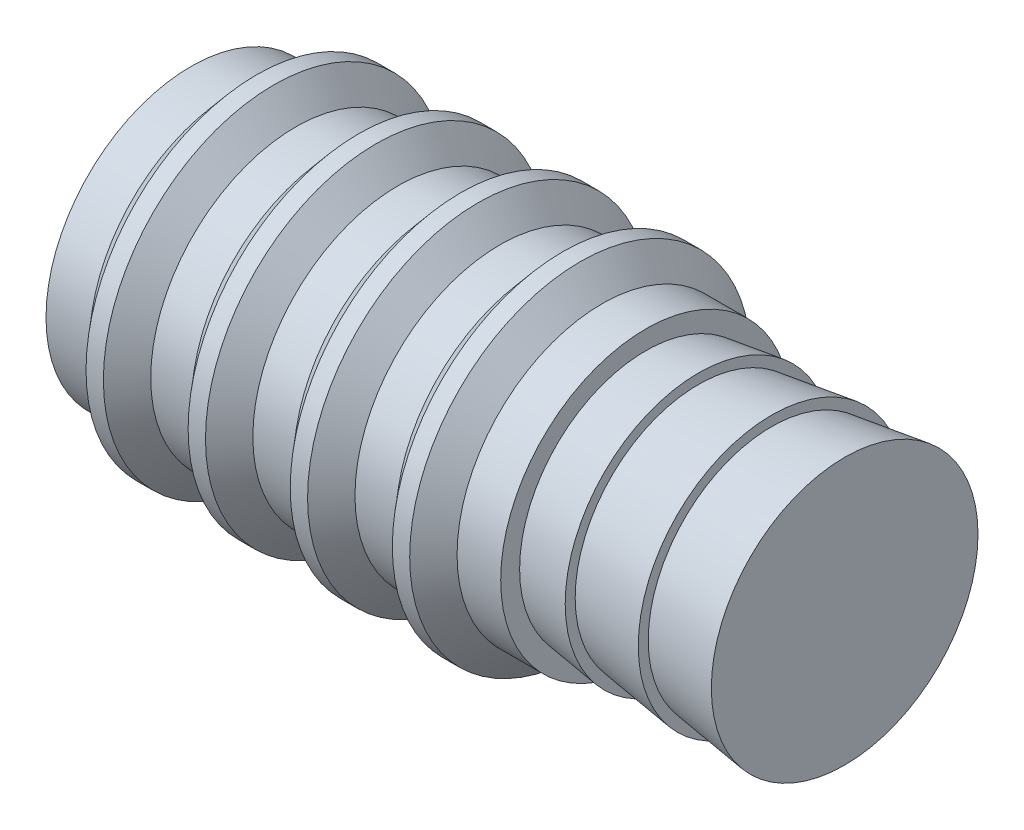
ISO-10303-21;
HEADER;
FILE_DESCRIPTION(('STEP AP214'),'2;1');
FILE_NAME('part.step','',(''),(''),'','','');
FILE_SCHEMA(('AUTOMOTIVE_DESIGN { 1 0 10303 214 1 1 1 1 }'));
ENDSEC;
DATA;
#1=APPLICATION_CONTEXT('core data for automotive mechanical design processes');
#2=APPLICATION_PROTOCOL_DEFINITION('international standard','automotive_design',2000,#1);
#3=PRODUCT_CONTEXT('',#1,'mechanical');
#4=PRODUCT('Part','Part','',(#3));
#5=PRODUCT_RELATED_PRODUCT_CATEGORY('part','',(#4));
#6=PRODUCT_DEFINITION_FORMATION('','',#4);
#7=PRODUCT_DEFINITION_CONTEXT('part definition',#1,'design');
#8=PRODUCT_DEFINITION('design','',#6,#7);
#9=PRODUCT_DEFINITION_SHAPE('','',#8);
#10=(LENGTH_UNIT() NAMED_UNIT(*) SI_UNIT(.MILLI.,.METRE.));
#11=(NAMED_UNIT(*) PLANE_ANGLE_UNIT() SI_UNIT($,.RADIAN.));
#12=(NAMED_UNIT(*) SI_UNIT($,.STERADIAN.) SOLID_ANGLE_UNIT());
#13=UNCERTAINTY_MEASURE_WITH_UNIT(LENGTH_MEASURE(1.E-05),#10,'distance_accuracy_value','');
#14=(GEOMETRIC_REPRESENTATION_CONTEXT(3) GLOBAL_UNCERTAINTY_ASSIGNED_CONTEXT((#13)) GLOBAL_UNIT_ASSIGNED_CONTEXT((#10,
#11,#12)) REPRESENTATION_CONTEXT('',''));
#15=CARTESIAN_POINT('',(0.,0.,0.));
#16=DIRECTION('',(0.,0.,1.));
#17=DIRECTION('',(1.,0.,0.));
#18=AXIS2_PLACEMENT_3D('',#15,#16,#17);
#19=CARTESIAN_POINT('',(11.5,0.,0.));
#20=DIRECTION('',(1.,0.,0.));
#21=DIRECTION('',(0.,0.,-1.));
#22=AXIS2_PLACEMENT_3D('',#19,#20,#21);
#23=PLANE('',#22);
#24=CARTESIAN_POINT('',(11.5,0.,0.));
#25=DIRECTION('',(-1.,0.,0.));
#26=DIRECTION('',(0.,0.,1.));
#27=AXIS2_PLACEMENT_3D('',#24,#25,#26);
#28=CIRCLE('',#27,2.34574421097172);
#29=CARTESIAN_POINT('',(11.5,0.,2.34574421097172));
#30=VERTEX_POINT('',#29);
#31=EDGE_CURVE('E9',#30,#30,#28,.T.);
#32=ORIENTED_EDGE('',*,*,#31,.F.);
#33=EDGE_LOOP('',(#32));
#34=FACE_BOUND('',#33,.T.);
#35=ADVANCED_FACE('F14',(#34),#23,.T.);
#36=CARTESIAN_POINT('',(10.2144174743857,0.,0.));
#37=DIRECTION('',(1.,0.,0.));
#38=DIRECTION('',(0.,0.,-1.));
#39=AXIS2_PLACEMENT_3D('',#36,#37,#38);
#40=CONICAL_SURFACE('',#39,2.17009195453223,0.135791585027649);
#41=ORIENTED_EDGE('',*,*,#31,.T.);
#42=EDGE_LOOP('',(#41));
#43=FACE_BOUND('',#42,.T.);
#44=CARTESIAN_POINT('',(10.2144174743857,0.,0.));
#45=DIRECTION('',(-1.,0.,0.));
#46=DIRECTION('',(0.,0.,1.));
#47=AXIS2_PLACEMENT_3D('',#44,#45,#46);
#48=CIRCLE('',#47,2.17009195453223);
#49=CARTESIAN_POINT('',(10.2144174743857,0.,2.17009195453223));
#50=VERTEX_POINT('',#49);
#51=EDGE_CURVE('E20',#50,#50,#48,.T.);
#52=ORIENTED_EDGE('',*,*,#51,.F.);
#53=EDGE_LOOP('',(#52));
#54=FACE_BOUND('',#53,.T.);
#55=ADVANCED_FACE('F146',(#43,#54),#40,.T.);
#56=CARTESIAN_POINT('',(10.2144174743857,0.,0.));
#57=DIRECTION('',(1.,0.,0.));
#58=DIRECTION('',(0.,0.,-1.));
#59=AXIS2_PLACEMENT_3D('',#56,#57,#58);
#60=PLANE('',#59);
#61=ORIENTED_EDGE('',*,*,#51,.T.);
#62=EDGE_LOOP('',(#61));
#63=FACE_BOUND('',#62,.T.);
#64=CARTESIAN_POINT('',(10.2144174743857,0.,0.));
#65=DIRECTION('',(-1.,0.,0.));
#66=DIRECTION('',(0.,0.,1.));
#67=AXIS2_PLACEMENT_3D('',#64,#65,#66);
#68=CIRCLE('',#67,2.34574421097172);
#69=CARTESIAN_POINT('',(10.2144174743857,0.,2.34574421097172));
#70=VERTEX_POINT('',#69);
#71=EDGE_CURVE('E24',#70,#70,#68,.T.);
#72=ORIENTED_EDGE('',*,*,#71,.F.);
#73=EDGE_LOOP('',(#72));
#74=FACE_BOUND('',#73,.T.);
#75=ADVANCED_FACE('F152',(#63,#74),#60,.T.);
#76=CARTESIAN_POINT('',(8.9288349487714,0.,0.));
#77=DIRECTION('',(1.,0.,0.));
#78=DIRECTION('',(0.,0.,-1.));
#79=AXIS2_PLACEMENT_3D('',#76,#77,#78);
#80=CONICAL_SURFACE('',#79,2.17009195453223,0.135791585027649);
#81=ORIENTED_EDGE('',*,*,#71,.T.);
#82=EDGE_LOOP('',(#81));
#83=FACE_BOUND('',#82,.T.);
#84=CARTESIAN_POINT('',(8.9288349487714,0.,0.));
#85=DIRECTION('',(-1.,0.,0.));
#86=DIRECTION('',(0.,0.,1.));
#87=AXIS2_PLACEMENT_3D('',#84,#85,#86);
#88=CIRCLE('',#87,2.17009195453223);
#89=CARTESIAN_POINT('',(8.9288349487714,0.,2.17009195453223));
#90=VERTEX_POINT('',#89);
#91=EDGE_CURVE('E28',#90,#90,#88,.T.);
#92=ORIENTED_EDGE('',*,*,#91,.F.);
#93=EDGE_LOOP('',(#92));
#94=FACE_BOUND('',#93,.T.);
#95=ADVANCED_FACE('F157',(#83,#94),#80,.T.);
#96=CARTESIAN_POINT('',(8.9288349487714,0.,0.));
#97=DIRECTION('',(1.,0.,0.));
#98=DIRECTION('',(0.,0.,-1.));
#99=AXIS2_PLACEMENT_3D('',#96,#97,#98);
#100=PLANE('',#99);
#101=ORIENTED_EDGE('',*,*,#91,.T.);
#102=EDGE_LOOP('',(#101));
#103=FACE_BOUND('',#102,.T.);
#104=CARTESIAN_POINT('',(8.9288349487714,0.,0.));
#105=DIRECTION('',(-1.,0.,0.));
#106=DIRECTION('',(0.,0.,1.));
#107=AXIS2_PLACEMENT_3D('',#104,#105,#106);
#108=CIRCLE('',#107,2.34574421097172);
#109=CARTESIAN_POINT('',(8.9288349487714,0.,2.34574421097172));
#110=VERTEX_POINT('',#109);
#111=EDGE_CURVE('E33',#110,#110,#108,.T.);
#112=ORIENTED_EDGE('',*,*,#111,.F.);
#113=EDGE_LOOP('',(#112));
#114=FACE_BOUND('',#113,.T.);
#115=ADVANCED_FACE('F163',(#103,#114),#100,.T.);
#116=CARTESIAN_POINT('',(8.,0.,0.));
#117=DIRECTION('',(1.,0.,0.));
#118=DIRECTION('',(0.,0.,-1.));
#119=AXIS2_PLACEMENT_3D('',#116,#117,#118);
#120=CONICAL_SURFACE('',#119,2.2188352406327,0.135791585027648);
#121=ORIENTED_EDGE('',*,*,#111,.T.);
#122=EDGE_LOOP('',(#121));
#123=FACE_BOUND('',#122,.T.);
#124=CARTESIAN_POINT('',(8.,0.,0.));
#125=DIRECTION('',(-1.,0.,0.));
#126=DIRECTION('',(0.,0.,1.));
#127=AXIS2_PLACEMENT_3D('',#124,#125,#126);
#128=CIRCLE('',#127,2.2188352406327);
#129=CARTESIAN_POINT('',(8.,0.,2.2188352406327));
#130=VERTEX_POINT('',#129);
#131=EDGE_CURVE('E36',#130,#130,#128,.T.);
#132=ORIENTED_EDGE('',*,*,#131,.F.);
#133=EDGE_LOOP('',(#132));
#134=FACE_BOUND('',#133,.T.);
#135=ADVANCED_FACE('F167',(#123,#134),#120,.T.);
#136=CARTESIAN_POINT('',(8.,0.,0.));
#137=DIRECTION('',(1.,0.,0.));
#138=DIRECTION('',(0.,0.,-1.));
#139=AXIS2_PLACEMENT_3D('',#136,#137,#138);
#140=PLANE('',#139);
#141=ORIENTED_EDGE('',*,*,#131,.T.);
#142=EDGE_LOOP('',(#141));
#143=FACE_BOUND('',#142,.T.);
#144=CARTESIAN_POINT('',(8.,0.,0.));
#145=DIRECTION('',(-1.,0.,0.));
#146=DIRECTION('',(0.,0.,1.));
#147=AXIS2_PLACEMENT_3D('',#144,#145,#146);
#148=CIRCLE('',#147,2.55133027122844);
#149=CARTESIAN_POINT('',(8.,0.,2.55133027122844));
#150=VERTEX_POINT('',#149);
#151=EDGE_CURVE('E39',#150,#150,#148,.T.);
#152=ORIENTED_EDGE('',*,*,#151,.F.);
#153=EDGE_LOOP('',(#152));
#154=FACE_BOUND('',#153,.T.);
#155=ADVANCED_FACE('F171',(#143,#154),#140,.T.);
#156=CARTESIAN_POINT('',(0.,0.,0.));
#157=DIRECTION('',(-1.,0.,0.));
#158=DIRECTION('',(0.,0.,1.));
#159=AXIS2_PLACEMENT_3D('',#156,#157,#158);
#160=CYLINDRICAL_SURFACE('',#159,2.55133027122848);
#161=CARTESIAN_POINT('',(7.23177629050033,0.,0.));
#162=DIRECTION('',(-1.,0.,0.));
#163=DIRECTION('',(0.,0.,1.));
#164=AXIS2_PLACEMENT_3D('',#161,#162,#163);
#165=CIRCLE('',#164,2.55133027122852);
#166=CARTESIAN_POINT('',(7.23177629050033,0.,2.55133027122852));
#167=VERTEX_POINT('',#166);
#168=EDGE_CURVE('E42',#167,#167,#165,.T.);
#169=ORIENTED_EDGE('',*,*,#168,.F.);
#170=EDGE_LOOP('',(#169));
#171=FACE_BOUND('',#170,.T.);
#172=ORIENTED_EDGE('',*,*,#151,.T.);
#173=EDGE_LOOP('',(#172));
#174=FACE_BOUND('',#173,.T.);
#175=ADVANCED_FACE('F175',(#171,#174),#160,.T.);
#176=CARTESIAN_POINT('',(7.23177629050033,0.,0.));
#177=DIRECTION('',(-1.,0.,0.));
#178=DIRECTION('',(0.,0.,1.));
#179=AXIS2_PLACEMENT_3D('',#176,#177,#178);
#180=CONICAL_SURFACE('',#179,2.55133027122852,0.862170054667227);
#181=CARTESIAN_POINT('',(6.84720223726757,0.,0.));
#182=DIRECTION('',(-1.,0.,0.));
#183=DIRECTION('',(0.,0.,1.));
#184=AXIS2_PLACEMENT_3D('',#181,#182,#183);
#185=CIRCLE('',#184,3.00000000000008);
#186=CARTESIAN_POINT('',(6.84720223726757,0.,3.00000000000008));
#187=VERTEX_POINT('',#186);
#188=EDGE_CURVE('E45',#187,#187,#185,.T.);
#189=ORIENTED_EDGE('',*,*,#188,.F.);
#190=EDGE_LOOP('',(#189));
#191=FACE_BOUND('',#190,.T.);
#192=ORIENTED_EDGE('',*,*,#168,.T.);
#193=EDGE_LOOP('',(#192));
#194=FACE_BOUND('',#193,.T.);
#195=ADVANCED_FACE('F179',(#191,#194),#180,.T.);
#196=CARTESIAN_POINT('',(0.,0.,0.));
#197=DIRECTION('',(-1.,0.,0.));
#198=DIRECTION('',(0.,0.,1.));
#199=AXIS2_PLACEMENT_3D('',#196,#197,#198);
#200=CYLINDRICAL_SURFACE('',#199,3.00000000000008);
#201=ORIENTED_EDGE('',*,*,#188,.T.);
#202=EDGE_LOOP('',(#201));
#203=FACE_BOUND('',#202,.T.);
#204=CARTESIAN_POINT('',(6.54182407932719,0.,0.));
#205=DIRECTION('',(-1.,0.,0.));
#206=DIRECTION('',(0.,0.,1.));
#207=AXIS2_PLACEMENT_3D('',#204,#205,#206);
#208=CIRCLE('',#207,3.00000000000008);
#209=CARTESIAN_POINT('',(6.54182407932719,0.,3.00000000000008));
#210=VERTEX_POINT('',#209);
#211=EDGE_CURVE('E48',#210,#210,#208,.T.);
#212=ORIENTED_EDGE('',*,*,#211,.F.);
#213=EDGE_LOOP('',(#212));
#214=FACE_BOUND('',#213,.T.);
#215=ADVANCED_FACE('F183',(#203,#214),#200,.T.);
#216=CARTESIAN_POINT('',(6.15725002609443,0.,0.));
#217=DIRECTION('',(1.,0.,0.));
#218=DIRECTION('',(0.,0.,-1.));
#219=AXIS2_PLACEMENT_3D('',#216,#217,#218);
#220=CONICAL_SURFACE('',#219,2.55133027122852,0.862170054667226);
#221=ORIENTED_EDGE('',*,*,#211,.T.);
#222=EDGE_LOOP('',(#221));
#223=FACE_BOUND('',#222,.T.);
#224=CARTESIAN_POINT('',(6.15725002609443,0.,0.));
#225=DIRECTION('',(-1.,0.,0.));
#226=DIRECTION('',(0.,0.,1.));
#227=AXIS2_PLACEMENT_3D('',#224,#225,#226);
#228=CIRCLE('',#227,2.55133027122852);
#229=CARTESIAN_POINT('',(6.15725002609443,0.,2.55133027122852));
#230=VERTEX_POINT('',#229);
#231=EDGE_CURVE('E51',#230,#230,#228,.T.);
#232=ORIENTED_EDGE('',*,*,#231,.F.);
#233=EDGE_LOOP('',(#232));
#234=FACE_BOUND('',#233,.T.);
#235=ADVANCED_FACE('F187',(#223,#234),#220,.T.);
#236=CARTESIAN_POINT('',(0.,0.,0.));
#237=DIRECTION('',(-1.,0.,0.));
#238=DIRECTION('',(0.,0.,1.));
#239=AXIS2_PLACEMENT_3D('',#236,#237,#238);
#240=CYLINDRICAL_SURFACE('',#239,2.55133027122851);
#241=CARTESIAN_POINT('',(5.43543418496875,0.,0.));
#242=DIRECTION('',(-1.,0.,0.));
#243=DIRECTION('',(0.,0.,1.));
#244=AXIS2_PLACEMENT_3D('',#241,#242,#243);
#245=CIRCLE('',#244,2.55133027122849);
#246=CARTESIAN_POINT('',(5.43543418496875,0.,2.55133027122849));
#247=VERTEX_POINT('',#246);
#248=EDGE_CURVE('E54',#247,#247,#245,.T.);
#249=ORIENTED_EDGE('',*,*,#248,.F.);
#250=EDGE_LOOP('',(#249));
#251=FACE_BOUND('',#250,.T.);
#252=ORIENTED_EDGE('',*,*,#231,.T.);
#253=EDGE_LOOP('',(#252));
#254=FACE_BOUND('',#253,.T.);
#255=ADVANCED_FACE('F191',(#251,#254),#240,.T.);
#256=CARTESIAN_POINT('',(5.43543418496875,0.,0.));
#257=DIRECTION('',(-1.,0.,0.));
#258=DIRECTION('',(0.,0.,1.));
#259=AXIS2_PLACEMENT_3D('',#256,#257,#258);
#260=CONICAL_SURFACE('',#259,2.55133027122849,0.862170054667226);
#261=CARTESIAN_POINT('',(5.05086013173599,0.,0.));
#262=DIRECTION('',(-1.,0.,0.));
#263=DIRECTION('',(0.,0.,1.));
#264=AXIS2_PLACEMENT_3D('',#261,#262,#263);
#265=CIRCLE('',#264,3.00000000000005);
#266=CARTESIAN_POINT('',(5.05086013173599,0.,3.00000000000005));
#267=VERTEX_POINT('',#266);
#268=EDGE_CURVE('E57',#267,#267,#265,.T.);
#269=ORIENTED_EDGE('',*,*,#268,.F.);
#270=EDGE_LOOP('',(#269));
#271=FACE_BOUND('',#270,.T.);
#272=ORIENTED_EDGE('',*,*,#248,.T.);
#273=EDGE_LOOP('',(#272));
#274=FACE_BOUND('',#273,.T.);
#275=ADVANCED_FACE('F195',(#271,#274),#260,.T.);
#276=CARTESIAN_POINT('',(0.,0.,0.));
#277=DIRECTION('',(-1.,0.,0.));
#278=DIRECTION('',(0.,0.,1.));
#279=AXIS2_PLACEMENT_3D('',#276,#277,#278);
#280=CYLINDRICAL_SURFACE('',#279,3.00000000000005);
#281=ORIENTED_EDGE('',*,*,#268,.T.);
#282=EDGE_LOOP('',(#281));
#283=FACE_BOUND('',#282,.T.);
#284=CARTESIAN_POINT('',(4.74548197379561,0.,0.));
#285=DIRECTION('',(-1.,0.,0.));
#286=DIRECTION('',(0.,0.,1.));
#287=AXIS2_PLACEMENT_3D('',#284,#285,#286);
#288=CIRCLE('',#287,3.00000000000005);
#289=CARTESIAN_POINT('',(4.74548197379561,0.,3.00000000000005));
#290=VERTEX_POINT('',#289);
#291=EDGE_CURVE('E60',#290,#290,#288,.T.);
#292=ORIENTED_EDGE('',*,*,#291,.F.);
#293=EDGE_LOOP('',(#292));
#294=FACE_BOUND('',#293,.T.);
#295=ADVANCED_FACE('F199',(#283,#294),#280,.T.);
#296=CARTESIAN_POINT('',(4.36090792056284,0.,0.));
#297=DIRECTION('',(1.,0.,0.));
#298=DIRECTION('',(0.,0.,-1.));
#299=AXIS2_PLACEMENT_3D('',#296,#297,#298);
#300=CONICAL_SURFACE('',#299,2.55133027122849,0.862170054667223);
#301=ORIENTED_EDGE('',*,*,#291,.T.);
#302=EDGE_LOOP('',(#301));
#303=FACE_BOUND('',#302,.T.);
#304=CARTESIAN_POINT('',(4.36090792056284,0.,0.));
#305=DIRECTION('',(-1.,0.,0.));
#306=DIRECTION('',(0.,0.,1.));
#307=AXIS2_PLACEMENT_3D('',#304,#305,#306);
#308=CIRCLE('',#307,2.55133027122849);
#309=CARTESIAN_POINT('',(4.36090792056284,0.,2.55133027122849));
#310=VERTEX_POINT('',#309);
#311=EDGE_CURVE('E63',#310,#310,#308,.T.);
#312=ORIENTED_EDGE('',*,*,#311,.F.);
#313=EDGE_LOOP('',(#312));
#314=FACE_BOUND('',#313,.T.);
#315=ADVANCED_FACE('F203',(#303,#314),#300,.T.);
#316=CARTESIAN_POINT('',(0.,0.,0.));
#317=DIRECTION('',(-1.,0.,0.));
#318=DIRECTION('',(0.,0.,1.));
#319=AXIS2_PLACEMENT_3D('',#316,#317,#318);
#320=CYLINDRICAL_SURFACE('',#319,2.55133027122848);
#321=CARTESIAN_POINT('',(3.63909207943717,0.,0.));
#322=DIRECTION('',(-1.,0.,0.));
#323=DIRECTION('',(0.,0.,1.));
#324=AXIS2_PLACEMENT_3D('',#321,#322,#323);
#325=CIRCLE('',#324,2.55133027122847);
#326=CARTESIAN_POINT('',(3.63909207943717,0.,2.55133027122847));
#327=VERTEX_POINT('',#326);
#328=EDGE_CURVE('E66',#327,#327,#325,.T.);
#329=ORIENTED_EDGE('',*,*,#328,.F.);
#330=EDGE_LOOP('',(#329));
#331=FACE_BOUND('',#330,.T.);
#332=ORIENTED_EDGE('',*,*,#311,.T.);
#333=EDGE_LOOP('',(#332));
#334=FACE_BOUND('',#333,.T.);
#335=ADVANCED_FACE('F207',(#331,#334),#320,.T.);
#336=CARTESIAN_POINT('',(3.63909207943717,0.,0.));
#337=DIRECTION('',(-1.,0.,0.));
#338=DIRECTION('',(0.,0.,1.));
#339=AXIS2_PLACEMENT_3D('',#336,#337,#338);
#340=CONICAL_SURFACE('',#339,2.55133027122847,0.862170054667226);
#341=CARTESIAN_POINT('',(3.25451802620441,0.,0.));
#342=DIRECTION('',(-1.,0.,0.));
#343=DIRECTION('',(0.,0.,1.));
#344=AXIS2_PLACEMENT_3D('',#341,#342,#343);
#345=CIRCLE('',#344,3.);
#346=CARTESIAN_POINT('',(3.25451802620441,0.,3.));
#347=VERTEX_POINT('',#346);
#348=EDGE_CURVE('E69',#347,#347,#345,.T.);
#349=ORIENTED_EDGE('',*,*,#348,.F.);
#350=EDGE_LOOP('',(#349));
#351=FACE_BOUND('',#350,.T.);
#352=ORIENTED_EDGE('',*,*,#328,.T.);
#353=EDGE_LOOP('',(#352));
#354=FACE_BOUND('',#353,.T.);
#355=ADVANCED_FACE('F211',(#351,#354),#340,.T.);
#356=CARTESIAN_POINT('',(0.,0.,0.));
#357=DIRECTION('',(-1.,0.,0.));
#358=DIRECTION('',(0.,0.,1.));
#359=AXIS2_PLACEMENT_3D('',#356,#357,#358);
#360=CYLINDRICAL_SURFACE('',#359,3.);
#361=ORIENTED_EDGE('',*,*,#348,.T.);
#362=EDGE_LOOP('',(#361));
#363=FACE_BOUND('',#362,.T.);
#364=CARTESIAN_POINT('',(2.94913986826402,0.,0.));
#365=DIRECTION('',(-1.,0.,0.));
#366=DIRECTION('',(0.,0.,1.));
#367=AXIS2_PLACEMENT_3D('',#364,#365,#366);
#368=CIRCLE('',#367,3.);
#369=CARTESIAN_POINT('',(2.94913986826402,0.,3.));
#370=VERTEX_POINT('',#369);
#371=EDGE_CURVE('E72',#370,#370,#368,.T.);
#372=ORIENTED_EDGE('',*,*,#371,.F.);
#373=EDGE_LOOP('',(#372));
#374=FACE_BOUND('',#373,.T.);
#375=ADVANCED_FACE('F215',(#363,#374),#360,.T.);
#376=CARTESIAN_POINT('',(2.56456581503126,0.,0.));
#377=DIRECTION('',(1.,0.,0.));
#378=DIRECTION('',(0.,0.,-1.));
#379=AXIS2_PLACEMENT_3D('',#376,#377,#378);
#380=CONICAL_SURFACE('',#379,2.55133027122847,0.862170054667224);
#381=ORIENTED_EDGE('',*,*,#371,.T.);
#382=EDGE_LOOP('',(#381));
#383=FACE_BOUND('',#382,.T.);
#384=CARTESIAN_POINT('',(2.56456581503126,0.,0.));
#385=DIRECTION('',(-1.,0.,0.));
#386=DIRECTION('',(0.,0.,1.));
#387=AXIS2_PLACEMENT_3D('',#384,#385,#386);
#388=CIRCLE('',#387,2.55133027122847);
#389=CARTESIAN_POINT('',(2.56456581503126,0.,2.55133027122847));
#390=VERTEX_POINT('',#389);
#391=EDGE_CURVE('E75',#390,#390,#388,.T.);
#392=ORIENTED_EDGE('',*,*,#391,.F.);
#393=EDGE_LOOP('',(#392));
#394=FACE_BOUND('',#393,.T.);
#395=ADVANCED_FACE('F219',(#383,#394),#380,.T.);
#396=CARTESIAN_POINT('',(0.,0.,0.));
#397=DIRECTION('',(-1.,0.,0.));
#398=DIRECTION('',(0.,0.,1.));
#399=AXIS2_PLACEMENT_3D('',#396,#397,#398);
#400=CYLINDRICAL_SURFACE('',#399,2.55133027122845);
#401=CARTESIAN_POINT('',(1.84274997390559,0.,0.));
#402=DIRECTION('',(-1.,0.,0.));
#403=DIRECTION('',(0.,0.,1.));
#404=AXIS2_PLACEMENT_3D('',#401,#402,#403);
#405=CIRCLE('',#404,2.55133027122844);
#406=CARTESIAN_POINT('',(1.84274997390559,0.,2.55133027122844));
#407=VERTEX_POINT('',#406);
#408=EDGE_CURVE('E78',#407,#407,#405,.T.);
#409=ORIENTED_EDGE('',*,*,#408,.F.);
#410=EDGE_LOOP('',(#409));
#411=FACE_BOUND('',#410,.T.);
#412=ORIENTED_EDGE('',*,*,#391,.T.);
#413=EDGE_LOOP('',(#412));
#414=FACE_BOUND('',#413,.T.);
#415=ADVANCED_FACE('F223',(#411,#414),#400,.T.);
#416=CARTESIAN_POINT('',(1.84274997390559,0.,0.));
#417=DIRECTION('',(-1.,0.,0.));
#418=DIRECTION('',(0.,0.,1.));
#419=AXIS2_PLACEMENT_3D('',#416,#417,#418);
#420=CONICAL_SURFACE('',#419,2.55133027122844,0.862170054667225);
#421=CARTESIAN_POINT('',(1.45817592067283,0.,0.));
#422=DIRECTION('',(-1.,0.,0.));
#423=DIRECTION('',(0.,0.,1.));
#424=AXIS2_PLACEMENT_3D('',#421,#422,#423);
#425=CIRCLE('',#424,3.);
#426=CARTESIAN_POINT('',(1.45817592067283,0.,3.));
#427=VERTEX_POINT('',#426);
#428=EDGE_CURVE('E81',#427,#427,#425,.T.);
#429=ORIENTED_EDGE('',*,*,#428,.F.);
#430=EDGE_LOOP('',(#429));
#431=FACE_BOUND('',#430,.T.);
#432=ORIENTED_EDGE('',*,*,#408,.T.);
#433=EDGE_LOOP('',(#432));
#434=FACE_BOUND('',#433,.T.);
#435=ADVANCED_FACE('F227',(#431,#434),#420,.T.);
#436=CARTESIAN_POINT('',(0.,0.,0.));
#437=DIRECTION('',(-1.,0.,0.));
#438=DIRECTION('',(0.,0.,1.));
#439=AXIS2_PLACEMENT_3D('',#436,#437,#438);
#440=CYLINDRICAL_SURFACE('',#439,3.);
#441=ORIENTED_EDGE('',*,*,#428,.T.);
#442=EDGE_LOOP('',(#441));
#443=FACE_BOUND('',#442,.T.);
#444=CARTESIAN_POINT('',(1.15279776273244,0.,0.));
#445=DIRECTION('',(-1.,0.,0.));
#446=DIRECTION('',(0.,0.,1.));
#447=AXIS2_PLACEMENT_3D('',#444,#445,#446);
#448=CIRCLE('',#447,3.);
#449=CARTESIAN_POINT('',(1.15279776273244,0.,3.));
#450=VERTEX_POINT('',#449);
#451=EDGE_CURVE('E84',#450,#450,#448,.T.);
#452=ORIENTED_EDGE('',*,*,#451,.F.);
#453=EDGE_LOOP('',(#452));
#454=FACE_BOUND('',#453,.T.);
#455=ADVANCED_FACE('F142',(#443,#454),#440,.T.);
#456=CARTESIAN_POINT('',(0.768223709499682,0.,0.));
#457=DIRECTION('',(1.,0.,0.));
#458=DIRECTION('',(0.,0.,-1.));
#459=AXIS2_PLACEMENT_3D('',#456,#457,#458);
#460=CONICAL_SURFACE('',#459,2.55133027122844,0.862170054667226);
#461=ORIENTED_EDGE('',*,*,#451,.T.);
#462=EDGE_LOOP('',(#461));
#463=FACE_BOUND('',#462,.T.);
#464=CARTESIAN_POINT('',(0.768223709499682,0.,0.));
#465=DIRECTION('',(-1.,0.,0.));
#466=DIRECTION('',(0.,0.,1.));
#467=AXIS2_PLACEMENT_3D('',#464,#465,#466);
#468=CIRCLE('',#467,2.55133027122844);
#469=CARTESIAN_POINT('',(0.768223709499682,0.,2.55133027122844));
#470=VERTEX_POINT('',#469);
#471=EDGE_CURVE('E87',#470,#470,#468,.T.);
#472=ORIENTED_EDGE('',*,*,#471,.F.);
#473=EDGE_LOOP('',(#472));
#474=FACE_BOUND('',#473,.T.);
#475=ADVANCED_FACE('F134',(#463,#474),#460,.T.);
#476=CARTESIAN_POINT('',(0.,0.,0.));
#477=DIRECTION('',(-1.,0.,0.));
#478=DIRECTION('',(0.,0.,1.));
#479=AXIS2_PLACEMENT_3D('',#476,#477,#478);
#480=CYLINDRICAL_SURFACE('',#479,2.55133027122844);
#481=ORIENTED_EDGE('',*,*,#471,.T.);
#482=EDGE_LOOP('',(#481));
#483=FACE_BOUND('',#482,.T.);
#484=CARTESIAN_POINT('',(0.,0.,0.));
#485=DIRECTION('',(-1.,0.,0.));
#486=DIRECTION('',(0.,0.,1.));
#487=AXIS2_PLACEMENT_3D('',#484,#485,#486);
#488=CIRCLE('',#487,2.55133027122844);
#489=CARTESIAN_POINT('',(0.,0.,2.55133027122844));
#490=VERTEX_POINT('',#489);
#491=EDGE_CURVE('E90',#490,#490,#488,.T.);
#492=ORIENTED_EDGE('',*,*,#491,.F.);
#493=EDGE_LOOP('',(#492));
#494=FACE_BOUND('',#493,.T.);
#495=ADVANCED_FACE('F129',(#483,#494),#480,.T.);
#496=CARTESIAN_POINT('',(0.,0.,0.));
#497=DIRECTION('',(-1.,0.,0.));
#498=DIRECTION('',(0.,0.,1.));
#499=AXIS2_PLACEMENT_3D('',#496,#497,#498);
#500=PLANE('',#499);
#501=CARTESIAN_POINT('',(0.,0.,0.));
#502=DIRECTION('',(-1.,0.,0.));
#503=DIRECTION('',(0.,0.,1.));
#504=AXIS2_PLACEMENT_3D('',#501,#502,#503);
#505=CIRCLE('',#504,2.);
#506=CARTESIAN_POINT('',(0.,0.,2.));
#507=VERTEX_POINT('',#506);
#508=EDGE_CURVE('E96',#507,#507,#505,.T.);
#509=ORIENTED_EDGE('',*,*,#508,.F.);
#510=EDGE_LOOP('',(#509));
#511=FACE_BOUND('',#510,.T.);
#512=ORIENTED_EDGE('',*,*,#491,.T.);
#513=EDGE_LOOP('',(#512));
#514=FACE_BOUND('',#513,.T.);
#515=ADVANCED_FACE('F123',(#511,#514),#500,.T.);
#516=CARTESIAN_POINT('',(0.,0.,0.));
#517=DIRECTION('',(-1.,0.,0.));
#518=DIRECTION('',(0.,0.,1.));
#519=AXIS2_PLACEMENT_3D('',#516,#517,#518);
#520=CONICAL_SURFACE('',#519,2.,0.0349065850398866);
#521=CARTESIAN_POINT('',(2.,0.,0.));
#522=DIRECTION('',(-1.,0.,0.));
#523=DIRECTION('',(0.,0.,1.));
#524=AXIS2_PLACEMENT_3D('',#521,#522,#523);
#525=CIRCLE('',#524,1.93015846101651);
#526=CARTESIAN_POINT('',(2.,0.,1.93015846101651));
#527=VERTEX_POINT('',#526);
#528=EDGE_CURVE('E93',#527,#527,#525,.T.);
#529=ORIENTED_EDGE('',*,*,#528,.F.);
#530=EDGE_LOOP('',(#529));
#531=FACE_BOUND('',#530,.T.);
#532=ORIENTED_EDGE('',*,*,#508,.T.);
#533=EDGE_LOOP('',(#532));
#534=FACE_BOUND('',#533,.T.);
#535=ADVANCED_FACE('F117',(#531,#534),#520,.F.);
#536=CARTESIAN_POINT('',(2.,0.,0.));
#537=DIRECTION('',(-1.,0.,0.));
#538=DIRECTION('',(0.,0.,1.));
#539=AXIS2_PLACEMENT_3D('',#536,#537,#538);
#540=PLANE('',#539);
#541=CARTESIAN_POINT('',(2.,0.,0.));
#542=DIRECTION('',(-1.,0.,0.));
#543=DIRECTION('',(0.,0.,1.));
#544=AXIS2_PLACEMENT_3D('',#541,#542,#543);
#545=CIRCLE('',#544,1.5);
#546=CARTESIAN_POINT('',(2.,0.,1.5));
#547=VERTEX_POINT('',#546);
#548=EDGE_CURVE('E100',#547,#547,#545,.T.);
#549=ORIENTED_EDGE('',*,*,#548,.F.);
#550=EDGE_LOOP('',(#549));
#551=FACE_BOUND('',#550,.T.);
#552=ORIENTED_EDGE('',*,*,#528,.T.);
#553=EDGE_LOOP('',(#552));
#554=FACE_BOUND('',#553,.T.);
#555=ADVANCED_FACE('F111',(#551,#554),#540,.T.);
#556=CARTESIAN_POINT('',(6.,0.,0.));
#557=DIRECTION('',(-1.,0.,0.));
#558=DIRECTION('',(0.,0.,1.));
#559=AXIS2_PLACEMENT_3D('',#556,#557,#558);
#560=CYLINDRICAL_SURFACE('',#559,1.5);
#561=CARTESIAN_POINT('',(6.,0.,0.));
#562=DIRECTION('',(-1.,0.,0.));
#563=DIRECTION('',(0.,0.,1.));
#564=AXIS2_PLACEMENT_3D('',#561,#562,#563);
#565=CIRCLE('',#564,1.5);
#566=CARTESIAN_POINT('',(6.,0.,1.5));
#567=VERTEX_POINT('',#566);
#568=EDGE_CURVE('E99',#567,#567,#565,.T.);
#569=ORIENTED_EDGE('',*,*,#568,.F.);
#570=EDGE_LOOP('',(#569));
#571=FACE_BOUND('',#570,.T.);
#572=ORIENTED_EDGE('',*,*,#548,.T.);
#573=EDGE_LOOP('',(#572));
#574=FACE_BOUND('',#573,.T.);
#575=ADVANCED_FACE('F108',(#571,#574),#560,.F.);
#576=CARTESIAN_POINT('',(6.,0.,0.));
#577=DIRECTION('',(-1.,0.,0.));
#578=DIRECTION('',(0.,0.,1.));
#579=AXIS2_PLACEMENT_3D('',#576,#577,#578);
#580=PLANE('',#579);
#581=ORIENTED_EDGE('',*,*,#568,.T.);
#582=EDGE_LOOP('',(#581));
#583=FACE_BOUND('',#582,.T.);
#584=ADVANCED_FACE('F106',(#583),#580,.T.);
#585=CLOSED_SHELL('',(#35,#55,#75,#95,#115,#135,#155,#175,#195,#215,#235,#255,#275,#295,#315,
#335,#355,#375,#395,#415,#435,#455,#475,#495,#515,#535,#555,#575,#584));
#586=MANIFOLD_SOLID_BREP('B1',#585);
#587=ADVANCED_BREP_SHAPE_REPRESENTATION('',(#18,#586),#14);
#588=SHAPE_DEFINITION_REPRESENTATION(#9,#587);
ENDSEC;
END-ISO-10303-21;
